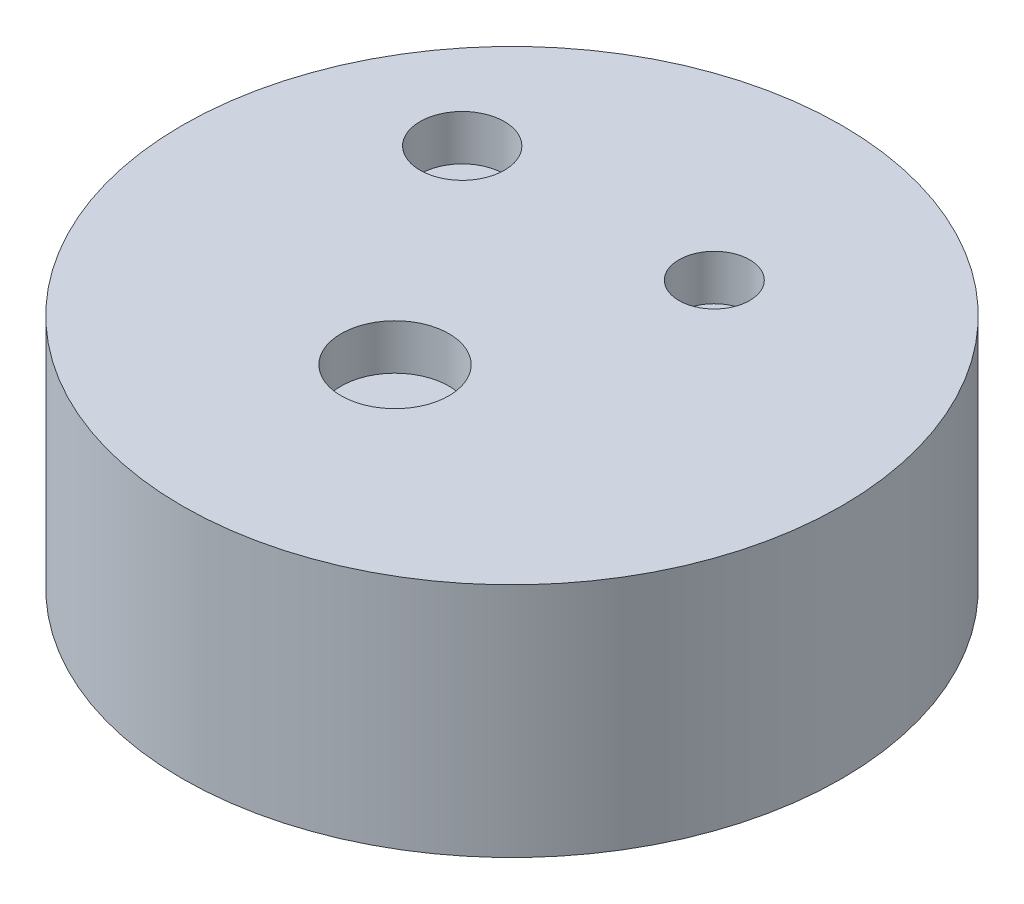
from build123d import *

# Parameters (mm, degrees)
SKETCH1_R           = 36.871673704
BOSS_EXTRUDE1_DEPTH = 26.416
SKETCH2_R           = 4.719401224
SKETCH2_R_2         = 3.956193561
SKETCH2_R_3         = 6.025487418
CUT_EXTRUDE1_DEPTH  = 5.08


with BuildPart() as part:
    # Sketch1 → Boss-Extrude1 (new body)
    with BuildSketch(Plane(origin=(0, 0, 0), x_dir=(1, 0, 0), z_dir=(0, 1, 0))):
        with Locations(Location((0, 0, 0), (0, 0, 270))):
            Circle(SKETCH1_R)
    extrude(amount=BOSS_EXTRUDE1_DEPTH)

    # Sketch2 → Cut-Extrude1 (cut)
    with BuildSketch(Plane(origin=(0, 26.416, 0), x_dir=(1, 0, 0), z_dir=(0, 1, 0))):
        with Locations(Location((-19.22121176, 13.655520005, 0), (0, 0, 270))):
            Circle(SKETCH2_R)
        with Locations(Location((7.876648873, 14.748238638, 0), (0, 0, 270))):
            Circle(SKETCH2_R_2)
        with Locations(Location((-1.786448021, -11.295248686, 0), (0, 0, 270))):
            Circle(SKETCH2_R_3)
    extrude(amount=-CUT_EXTRUDE1_DEPTH, mode=Mode.SUBTRACT)


solid = part.part
